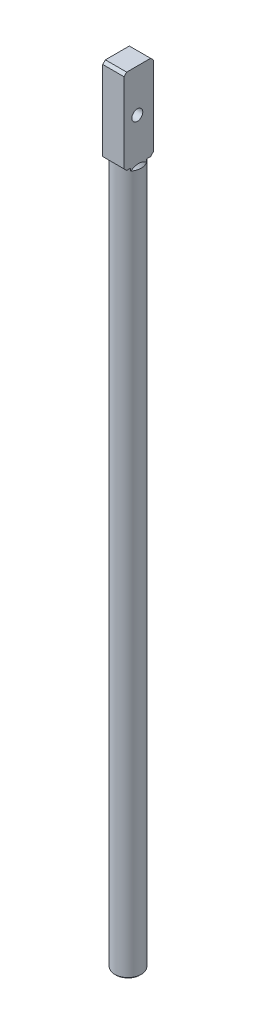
ISO-10303-21;
HEADER;
FILE_DESCRIPTION(('STEP AP214'),'2;1');
FILE_NAME('part.step','',(''),(''),'','','');
FILE_SCHEMA(('AUTOMOTIVE_DESIGN { 1 0 10303 214 1 1 1 1 }'));
ENDSEC;
DATA;
#1=APPLICATION_CONTEXT('core data for automotive mechanical design processes');
#2=APPLICATION_PROTOCOL_DEFINITION('international standard','automotive_design',2000,#1);
#3=PRODUCT_CONTEXT('',#1,'mechanical');
#4=PRODUCT('Part','Part','',(#3));
#5=PRODUCT_RELATED_PRODUCT_CATEGORY('part','',(#4));
#6=PRODUCT_DEFINITION_FORMATION('','',#4);
#7=PRODUCT_DEFINITION_CONTEXT('part definition',#1,'design');
#8=PRODUCT_DEFINITION('design','',#6,#7);
#9=PRODUCT_DEFINITION_SHAPE('','',#8);
#10=(LENGTH_UNIT() NAMED_UNIT(*) SI_UNIT(.MILLI.,.METRE.));
#11=(NAMED_UNIT(*) PLANE_ANGLE_UNIT() SI_UNIT($,.RADIAN.));
#12=(NAMED_UNIT(*) SI_UNIT($,.STERADIAN.) SOLID_ANGLE_UNIT());
#13=UNCERTAINTY_MEASURE_WITH_UNIT(LENGTH_MEASURE(1.E-05),#10,'distance_accuracy_value','');
#14=(GEOMETRIC_REPRESENTATION_CONTEXT(3) GLOBAL_UNCERTAINTY_ASSIGNED_CONTEXT((#13)) GLOBAL_UNIT_ASSIGNED_CONTEXT((#10,
#11,#12)) REPRESENTATION_CONTEXT('',''));
#15=CARTESIAN_POINT('',(0.,0.,0.));
#16=DIRECTION('',(0.,0.,1.));
#17=DIRECTION('',(1.,0.,0.));
#18=AXIS2_PLACEMENT_3D('',#15,#16,#17);
#19=CARTESIAN_POINT('',(4.,264.,-5.5));
#20=DIRECTION('',(0.,-1.,0.));
#21=DIRECTION('',(0.,0.,-1.));
#22=AXIS2_PLACEMENT_3D('',#19,#20,#21);
#23=PLANE('',#22);
#24=DIRECTION('',(0.,0.,1.));
#25=VECTOR('',#24,1.);
#26=CARTESIAN_POINT('',(-4.,264.,5.5));
#27=LINE('',#26,#25);
#28=CARTESIAN_POINT('',(-4.,264.,-4.49999999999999));
#29=VERTEX_POINT('',#28);
#30=CARTESIAN_POINT('',(-4.,264.,-3.));
#31=VERTEX_POINT('',#30);
#32=EDGE_CURVE('E344',#29,#31,#27,.T.);
#33=ORIENTED_EDGE('',*,*,#32,.F.);
#34=DIRECTION('',(1.,0.,0.));
#35=VECTOR('',#34,1.);
#36=CARTESIAN_POINT('',(4.,264.,-4.49999999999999));
#37=LINE('',#36,#35);
#38=CARTESIAN_POINT('',(-2.17944947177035,264.,-4.49999999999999));
#39=VERTEX_POINT('',#38);
#40=EDGE_CURVE('E225',#29,#39,#37,.T.);
#41=ORIENTED_EDGE('',*,*,#40,.T.);
#42=CARTESIAN_POINT('',(0.,264.,0.));
#43=DIRECTION('',(0.,1.,0.));
#44=DIRECTION('',(0.,0.,1.));
#45=AXIS2_PLACEMENT_3D('',#42,#43,#44);
#46=CIRCLE('',#45,5.);
#47=EDGE_CURVE('E170',#39,#31,#46,.T.);
#48=ORIENTED_EDGE('',*,*,#47,.T.);
#49=EDGE_LOOP('',(#33,#41,#48));
#50=FACE_BOUND('',#49,.T.);
#51=ADVANCED_FACE('F36',(#50),#23,.T.);
#52=DIRECTION('',(0.,0.,-1.));
#53=VECTOR('',#52,1.);
#54=CARTESIAN_POINT('',(4.,264.,5.5));
#55=LINE('',#54,#53);
#56=CARTESIAN_POINT('',(4.,264.,4.49999999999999));
#57=VERTEX_POINT('',#56);
#58=CARTESIAN_POINT('',(4.,264.,3.));
#59=VERTEX_POINT('',#58);
#60=EDGE_CURVE('E144',#57,#59,#55,.T.);
#61=ORIENTED_EDGE('',*,*,#60,.F.);
#62=DIRECTION('',(-1.,0.,0.));
#63=VECTOR('',#62,1.);
#64=CARTESIAN_POINT('',(-4.,264.,4.49999999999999));
#65=LINE('',#64,#63);
#66=CARTESIAN_POINT('',(2.17944947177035,264.,4.49999999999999));
#67=VERTEX_POINT('',#66);
#68=EDGE_CURVE('E166',#57,#67,#65,.T.);
#69=ORIENTED_EDGE('',*,*,#68,.T.);
#70=EDGE_CURVE('E160',#67,#59,#46,.T.);
#71=ORIENTED_EDGE('',*,*,#70,.T.);
#72=EDGE_LOOP('',(#61,#69,#71));
#73=FACE_BOUND('',#72,.T.);
#74=ADVANCED_FACE('F165',(#73),#23,.T.);
#75=CARTESIAN_POINT('',(0.,264.,0.));
#76=DIRECTION('',(0.,-1.,0.));
#77=DIRECTION('',(0.,0.,-1.));
#78=AXIS2_PLACEMENT_3D('',#75,#76,#77);
#79=CYLINDRICAL_SURFACE('',#78,5.);
#80=CARTESIAN_POINT('',(0.,0.500000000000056,0.));
#81=DIRECTION('',(0.,1.,0.));
#82=DIRECTION('',(0.,0.,1.));
#83=AXIS2_PLACEMENT_3D('',#80,#81,#82);
#84=CIRCLE('',#83,5.);
#85=CARTESIAN_POINT('',(0.,0.500000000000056,5.));
#86=VERTEX_POINT('',#85);
#87=EDGE_CURVE('E44',#86,#86,#84,.T.);
#88=ORIENTED_EDGE('',*,*,#87,.T.);
#89=EDGE_LOOP('',(#88));
#90=FACE_BOUND('',#89,.T.);
#91=CARTESIAN_POINT('',(4.,264.,-3.));
#92=VERTEX_POINT('',#91);
#93=CARTESIAN_POINT('',(2.17944947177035,264.,-4.49999999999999));
#94=VERTEX_POINT('',#93);
#95=EDGE_CURVE('E172',#92,#94,#46,.T.);
#96=ORIENTED_EDGE('',*,*,#95,.F.);
#97=DIRECTION('',(0.,-1.,0.));
#98=VECTOR('',#97,1.);
#99=CARTESIAN_POINT('',(4.,264.,-3.));
#100=LINE('',#99,#98);
#101=CARTESIAN_POINT('',(4.,263.,-3.));
#102=VERTEX_POINT('',#101);
#103=EDGE_CURVE('E59',#92,#102,#100,.T.);
#104=ORIENTED_EDGE('',*,*,#103,.T.);
#105=CARTESIAN_POINT('',(0.,263.,0.));
#106=DIRECTION('',(0.,1.,0.));
#107=DIRECTION('',(0.,0.,1.));
#108=AXIS2_PLACEMENT_3D('',#105,#106,#107);
#109=CIRCLE('',#108,5.);
#110=CARTESIAN_POINT('',(4.,263.,3.));
#111=VERTEX_POINT('',#110);
#112=EDGE_CURVE('E163',#102,#111,#109,.F.);
#113=ORIENTED_EDGE('',*,*,#112,.T.);
#114=DIRECTION('',(0.,-1.,0.));
#115=VECTOR('',#114,1.);
#116=CARTESIAN_POINT('',(4.,263.,3.));
#117=LINE('',#116,#115);
#118=EDGE_CURVE('E148',#111,#59,#117,.F.);
#119=ORIENTED_EDGE('',*,*,#118,.T.);
#120=ORIENTED_EDGE('',*,*,#70,.F.);
#121=CARTESIAN_POINT('',(0.,259.5,0.));
#122=DIRECTION('',(0.,-0.70710678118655,0.707106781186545));
#123=DIRECTION('',(0.,-0.707106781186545,-0.70710678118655));
#124=AXIS2_PLACEMENT_3D('',#121,#122,#123);
#125=ELLIPSE('',#124,7.07106781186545,5.);
#126=CARTESIAN_POINT('',(-2.17944947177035,264.,4.49999999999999));
#127=VERTEX_POINT('',#126);
#128=EDGE_CURVE('E275',#67,#127,#125,.T.);
#129=ORIENTED_EDGE('',*,*,#128,.T.);
#130=CARTESIAN_POINT('',(-4.,264.,3.));
#131=VERTEX_POINT('',#130);
#132=EDGE_CURVE('E167',#131,#127,#46,.T.);
#133=ORIENTED_EDGE('',*,*,#132,.F.);
#134=DIRECTION('',(0.,-1.,0.));
#135=VECTOR('',#134,1.);
#136=CARTESIAN_POINT('',(-4.,264.,3.));
#137=LINE('',#136,#135);
#138=CARTESIAN_POINT('',(-4.,263.,3.));
#139=VERTEX_POINT('',#138);
#140=EDGE_CURVE('E51',#131,#139,#137,.T.);
#141=ORIENTED_EDGE('',*,*,#140,.T.);
#142=CARTESIAN_POINT('',(0.,263.,0.));
#143=DIRECTION('',(0.,1.,0.));
#144=DIRECTION('',(0.,0.,1.));
#145=AXIS2_PLACEMENT_3D('',#142,#143,#144);
#146=CIRCLE('',#145,5.);
#147=CARTESIAN_POINT('',(-4.,263.,-3.));
#148=VERTEX_POINT('',#147);
#149=EDGE_CURVE('E187',#139,#148,#146,.F.);
#150=ORIENTED_EDGE('',*,*,#149,.T.);
#151=DIRECTION('',(0.,-1.,0.));
#152=VECTOR('',#151,1.);
#153=CARTESIAN_POINT('',(-4.,263.,-3.));
#154=LINE('',#153,#152);
#155=EDGE_CURVE('E182',#148,#31,#154,.F.);
#156=ORIENTED_EDGE('',*,*,#155,.T.);
#157=ORIENTED_EDGE('',*,*,#47,.F.);
#158=CARTESIAN_POINT('',(0.,259.5,0.));
#159=DIRECTION('',(0.,-0.70710678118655,-0.707106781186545));
#160=DIRECTION('',(0.,-0.707106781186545,0.70710678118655));
#161=AXIS2_PLACEMENT_3D('',#158,#159,#160);
#162=ELLIPSE('',#161,7.07106781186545,5.);
#163=EDGE_CURVE('E323',#39,#94,#162,.T.);
#164=ORIENTED_EDGE('',*,*,#163,.T.);
#165=EDGE_LOOP('',(#96,#104,#113,#119,#120,#129,#133,#141,#150,#156,#157,#164));
#166=FACE_BOUND('',#165,.T.);
#167=ADVANCED_FACE('F159',(#90,#166),#79,.T.);
#168=CARTESIAN_POINT('',(0.,0.,0.));
#169=DIRECTION('',(0.,1.,0.));
#170=DIRECTION('',(0.,0.,1.));
#171=AXIS2_PLACEMENT_3D('',#168,#169,#170);
#172=PLANE('',#171);
#173=CARTESIAN_POINT('',(0.,0.,0.));
#174=DIRECTION('',(0.,1.,0.));
#175=DIRECTION('',(0.,0.,1.));
#176=AXIS2_PLACEMENT_3D('',#173,#174,#175);
#177=CIRCLE('',#176,4.49999999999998);
#178=CARTESIAN_POINT('',(0.,0.,4.49999999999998));
#179=VERTEX_POINT('',#178);
#180=EDGE_CURVE('E11',#179,#179,#177,.F.);
#181=ORIENTED_EDGE('',*,*,#180,.T.);
#182=EDGE_LOOP('',(#181));
#183=FACE_BOUND('',#182,.T.);
#184=ADVANCED_FACE('F306',(#183),#172,.F.);
#185=ORIENTED_EDGE('',*,*,#95,.T.);
#186=DIRECTION('',(1.,0.,0.));
#187=VECTOR('',#186,1.);
#188=CARTESIAN_POINT('',(4.,264.,-4.49999999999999));
#189=LINE('',#188,#187);
#190=CARTESIAN_POINT('',(4.,264.,-4.49999999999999));
#191=VERTEX_POINT('',#190);
#192=EDGE_CURVE('E223',#94,#191,#189,.T.);
#193=ORIENTED_EDGE('',*,*,#192,.T.);
#194=EDGE_CURVE('E155',#92,#191,#55,.T.);
#195=ORIENTED_EDGE('',*,*,#194,.F.);
#196=EDGE_LOOP('',(#185,#193,#195));
#197=FACE_BOUND('',#196,.T.);
#198=ADVANCED_FACE('F291',(#197),#23,.T.);
#199=CARTESIAN_POINT('',(4.,296.,5.5));
#200=DIRECTION('',(-1.,0.,0.));
#201=DIRECTION('',(0.,0.,1.));
#202=AXIS2_PLACEMENT_3D('',#199,#200,#201);
#203=PLANE('',#202);
#204=CARTESIAN_POINT('',(4.,280.,0.5));
#205=DIRECTION('',(-1.,0.,0.));
#206=DIRECTION('',(0.,0.,1.));
#207=AXIS2_PLACEMENT_3D('',#204,#205,#206);
#208=CIRCLE('',#207,2.05000000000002);
#209=CARTESIAN_POINT('',(4.,280.,2.55000000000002));
#210=VERTEX_POINT('',#209);
#211=EDGE_CURVE('E351',#210,#210,#208,.T.);
#212=ORIENTED_EDGE('',*,*,#211,.T.);
#213=EDGE_LOOP('',(#212));
#214=FACE_BOUND('',#213,.T.);
#215=DIRECTION('',(0.,-1.,0.));
#216=VECTOR('',#215,1.);
#217=CARTESIAN_POINT('',(4.,296.,5.5));
#218=LINE('',#217,#216);
#219=CARTESIAN_POINT('',(4.,295.,5.5));
#220=VERTEX_POINT('',#219);
#221=CARTESIAN_POINT('',(4.,265.,5.5));
#222=VERTEX_POINT('',#221);
#223=EDGE_CURVE('E337',#220,#222,#218,.T.);
#224=ORIENTED_EDGE('',*,*,#223,.T.);
#225=DIRECTION('',(0.,-0.707106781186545,-0.70710678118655));
#226=VECTOR('',#225,1.);
#227=CARTESIAN_POINT('',(4.,265.,5.5));
#228=LINE('',#227,#226);
#229=EDGE_CURVE('E150',#222,#57,#228,.T.);
#230=ORIENTED_EDGE('',*,*,#229,.T.);
#231=ORIENTED_EDGE('',*,*,#60,.T.);
#232=ORIENTED_EDGE('',*,*,#118,.F.);
#233=CARTESIAN_POINT('',(4.,263.,3.));
#234=CARTESIAN_POINT('',(4.,263.043418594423,2.92762836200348));
#235=CARTESIAN_POINT('',(4.,263.086104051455,2.85481802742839));
#236=CARTESIAN_POINT('',(4.,263.16980105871,2.70821938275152));
#237=CARTESIAN_POINT('',(4.,263.210812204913,2.63443084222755));
#238=CARTESIAN_POINT('',(4.,263.331258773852,2.41100406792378));
#239=CARTESIAN_POINT('',(4.,263.407814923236,2.25978602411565));
#240=CARTESIAN_POINT('',(4.,263.549076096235,1.95659067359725));
#241=CARTESIAN_POINT('',(4.,263.614035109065,1.80473273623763));
#242=CARTESIAN_POINT('',(4.,263.731616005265,1.49644202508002));
#243=CARTESIAN_POINT('',(4.,263.784254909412,1.34001590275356));
#244=CARTESIAN_POINT('',(4.,263.856172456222,1.08612110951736));
#245=CARTESIAN_POINT('',(4.,263.880380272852,0.990042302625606));
#246=CARTESIAN_POINT('',(4.,263.922558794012,0.796520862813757));
#247=CARTESIAN_POINT('',(4.,263.940530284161,0.699078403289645));
#248=CARTESIAN_POINT('',(4.,263.969854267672,0.501704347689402));
#249=CARTESIAN_POINT('',(4.,263.981104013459,0.401757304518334));
#250=CARTESIAN_POINT('',(4.,263.99620468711,0.201215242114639));
#251=CARTESIAN_POINT('',(4.,264.000048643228,0.100619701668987));
#252=CARTESIAN_POINT('',(4.,264.,0.));
#253=B_SPLINE_CURVE_WITH_KNOTS('',3,(#233,#234,#235,#236,#237,#238,#239,#240,#241,#242,#243,
#244,#245,#246,#247,#248,#249,#250,#251,#252),.UNSPECIFIED.,.F.,.F.,(4,2,2,2,2,2,2,2,2,4),(0.,
0.253181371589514,0.506423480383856,1.01459556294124,1.50970891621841,2.00413415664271,
2.30120350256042,2.59823541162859,2.89969868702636,3.20144561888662),.UNSPECIFIED.);
#254=CARTESIAN_POINT('',(4.00000000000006,264.,0.));
#255=VERTEX_POINT('',#254);
#256=EDGE_CURVE('E240',#111,#255,#253,.T.);
#257=ORIENTED_EDGE('',*,*,#256,.T.);
#258=CARTESIAN_POINT('',(4.00000000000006,264.,0.));
#259=CARTESIAN_POINT('',(4.00000000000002,264.000004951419,-0.0614896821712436));
#260=CARTESIAN_POINT('',(4.00000000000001,263.99858142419,-0.122970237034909));
#261=CARTESIAN_POINT('',(3.99999999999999,263.992923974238,-0.245792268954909));
#262=CARTESIAN_POINT('',(4.,263.988690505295,-0.307133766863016));
#263=CARTESIAN_POINT('',(4.,263.971868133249,-0.490538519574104));
#264=CARTESIAN_POINT('',(4.,263.955156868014,-0.612243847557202));
#265=CARTESIAN_POINT('',(4.,263.911987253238,-0.851773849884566));
#266=CARTESIAN_POINT('',(4.,263.885695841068,-0.969629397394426));
#267=CARTESIAN_POINT('',(4.,263.824503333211,-1.20311028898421));
#268=CARTESIAN_POINT('',(4.,263.789598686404,-1.31873469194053));
#269=CARTESIAN_POINT('',(4.,263.705139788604,-1.56915278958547));
#270=CARTESIAN_POINT('',(4.,263.654062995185,-1.70342909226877));
#271=CARTESIAN_POINT('',(4.,263.543490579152,-1.96849997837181));
#272=CARTESIAN_POINT('',(4.,263.483990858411,-2.09929282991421));
#273=CARTESIAN_POINT('',(4.,263.356956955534,-2.36033095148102));
#274=CARTESIAN_POINT('',(4.,263.289278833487,-2.49050544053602));
#275=CARTESIAN_POINT('',(4.,263.148432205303,-2.74756392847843));
#276=CARTESIAN_POINT('',(4.,263.075273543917,-2.87445330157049));
#277=CARTESIAN_POINT('',(4.,263.,-2.99999999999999));
#278=B_SPLINE_CURVE_WITH_KNOTS('',3,(#258,#259,#260,#261,#262,#263,#264,#265,#266,#267,#268,
#269,#270,#271,#272,#273,#274,#275,#276,#277),.UNSPECIFIED.,.F.,.F.,(4,2,2,2,2,2,2,2,2,4),(0.,
0.184435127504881,0.36884047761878,0.736868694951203,1.09876868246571,1.4608181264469,
1.8914446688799,2.32228145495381,2.76227942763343,3.20150515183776),.UNSPECIFIED.);
#279=EDGE_CURVE('E233',#255,#102,#278,.T.);
#280=ORIENTED_EDGE('',*,*,#279,.T.);
#281=ORIENTED_EDGE('',*,*,#103,.F.);
#282=ORIENTED_EDGE('',*,*,#194,.T.);
#283=DIRECTION('',(0.,0.707106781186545,-0.70710678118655));
#284=VECTOR('',#283,1.);
#285=CARTESIAN_POINT('',(4.,265.,-5.5));
#286=LINE('',#285,#284);
#287=CARTESIAN_POINT('',(4.,265.,-5.5));
#288=VERTEX_POINT('',#287);
#289=EDGE_CURVE('E204',#191,#288,#286,.T.);
#290=ORIENTED_EDGE('',*,*,#289,.T.);
#291=DIRECTION('',(0.,-1.,0.));
#292=VECTOR('',#291,1.);
#293=CARTESIAN_POINT('',(4.,296.,-5.5));
#294=LINE('',#293,#292);
#295=CARTESIAN_POINT('',(4.,295.,-5.5));
#296=VERTEX_POINT('',#295);
#297=EDGE_CURVE('E168',#296,#288,#294,.T.);
#298=ORIENTED_EDGE('',*,*,#297,.F.);
#299=DIRECTION('',(0.,-0.707106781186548,-0.707106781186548));
#300=VECTOR('',#299,1.);
#301=CARTESIAN_POINT('',(4.,296.,-4.5));
#302=LINE('',#301,#300);
#303=CARTESIAN_POINT('',(4.,296.,-4.5));
#304=VERTEX_POINT('',#303);
#305=EDGE_CURVE('E200',#296,#304,#302,.F.);
#306=ORIENTED_EDGE('',*,*,#305,.T.);
#307=DIRECTION('',(0.,0.,-1.));
#308=VECTOR('',#307,1.);
#309=CARTESIAN_POINT('',(4.,296.,5.5));
#310=LINE('',#309,#308);
#311=CARTESIAN_POINT('',(4.,296.,4.5));
#312=VERTEX_POINT('',#311);
#313=EDGE_CURVE('E345',#312,#304,#310,.T.);
#314=ORIENTED_EDGE('',*,*,#313,.F.);
#315=DIRECTION('',(0.,0.707106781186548,-0.707106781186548));
#316=VECTOR('',#315,1.);
#317=CARTESIAN_POINT('',(4.,296.,4.5));
#318=LINE('',#317,#316);
#319=EDGE_CURVE('E202',#312,#220,#318,.F.);
#320=ORIENTED_EDGE('',*,*,#319,.T.);
#321=EDGE_LOOP('',(#224,#230,#231,#232,#257,#280,#281,#282,#290,#298,#306,#314,#320));
#322=FACE_BOUND('',#321,.T.);
#323=ADVANCED_FACE('F147',(#214,#322),#203,.F.);
#324=CARTESIAN_POINT('',(-4.,296.,-5.5));
#325=DIRECTION('',(0.,0.,1.));
#326=DIRECTION('',(1.,0.,0.));
#327=AXIS2_PLACEMENT_3D('',#324,#325,#326);
#328=PLANE('',#327);
#329=ORIENTED_EDGE('',*,*,#297,.T.);
#330=DIRECTION('',(-1.,0.,0.));
#331=VECTOR('',#330,1.);
#332=CARTESIAN_POINT('',(-4.,265.,-5.5));
#333=LINE('',#332,#331);
#334=CARTESIAN_POINT('',(-4.,265.,-5.5));
#335=VERTEX_POINT('',#334);
#336=EDGE_CURVE('E220',#288,#335,#333,.T.);
#337=ORIENTED_EDGE('',*,*,#336,.T.);
#338=DIRECTION('',(0.,-1.,0.));
#339=VECTOR('',#338,1.);
#340=CARTESIAN_POINT('',(-4.,296.,-5.5));
#341=LINE('',#340,#339);
#342=CARTESIAN_POINT('',(-4.,295.,-5.5));
#343=VERTEX_POINT('',#342);
#344=EDGE_CURVE('E174',#343,#335,#341,.T.);
#345=ORIENTED_EDGE('',*,*,#344,.F.);
#346=DIRECTION('',(1.,0.,0.));
#347=VECTOR('',#346,1.);
#348=CARTESIAN_POINT('',(-4.,295.,-5.5));
#349=LINE('',#348,#347);
#350=EDGE_CURVE('E218',#343,#296,#349,.T.);
#351=ORIENTED_EDGE('',*,*,#350,.T.);
#352=EDGE_LOOP('',(#329,#337,#345,#351));
#353=FACE_BOUND('',#352,.T.);
#354=ADVANCED_FACE('F282',(#353),#328,.F.);
#355=CARTESIAN_POINT('',(-4.,296.,5.5));
#356=DIRECTION('',(1.,0.,0.));
#357=DIRECTION('',(0.,0.,-1.));
#358=AXIS2_PLACEMENT_3D('',#355,#356,#357);
#359=PLANE('',#358);
#360=CARTESIAN_POINT('',(-4.,280.,0.5));
#361=DIRECTION('',(-1.,0.,0.));
#362=DIRECTION('',(0.,0.,1.));
#363=AXIS2_PLACEMENT_3D('',#360,#361,#362);
#364=CIRCLE('',#363,2.05000000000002);
#365=CARTESIAN_POINT('',(-4.,280.,2.55000000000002));
#366=VERTEX_POINT('',#365);
#367=EDGE_CURVE('E354',#366,#366,#364,.T.);
#368=ORIENTED_EDGE('',*,*,#367,.F.);
#369=EDGE_LOOP('',(#368));
#370=FACE_BOUND('',#369,.T.);
#371=CARTESIAN_POINT('',(-4.,264.,4.49999999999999));
#372=VERTEX_POINT('',#371);
#373=EDGE_CURVE('E154',#131,#372,#27,.T.);
#374=ORIENTED_EDGE('',*,*,#373,.T.);
#375=DIRECTION('',(0.,0.707106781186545,0.70710678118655));
#376=VECTOR('',#375,1.);
#377=CARTESIAN_POINT('',(-4.,265.,5.5));
#378=LINE('',#377,#376);
#379=CARTESIAN_POINT('',(-4.,265.,5.5));
#380=VERTEX_POINT('',#379);
#381=EDGE_CURVE('E216',#372,#380,#378,.T.);
#382=ORIENTED_EDGE('',*,*,#381,.T.);
#383=DIRECTION('',(0.,-1.,0.));
#384=VECTOR('',#383,1.);
#385=CARTESIAN_POINT('',(-4.,296.,5.5));
#386=LINE('',#385,#384);
#387=CARTESIAN_POINT('',(-4.,295.,5.5));
#388=VERTEX_POINT('',#387);
#389=EDGE_CURVE('E332',#388,#380,#386,.T.);
#390=ORIENTED_EDGE('',*,*,#389,.F.);
#391=DIRECTION('',(0.,-0.707106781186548,0.707106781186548));
#392=VECTOR('',#391,1.);
#393=CARTESIAN_POINT('',(-4.,296.,4.5));
#394=LINE('',#393,#392);
#395=CARTESIAN_POINT('',(-4.,296.,4.5));
#396=VERTEX_POINT('',#395);
#397=EDGE_CURVE('E212',#388,#396,#394,.F.);
#398=ORIENTED_EDGE('',*,*,#397,.T.);
#399=DIRECTION('',(0.,0.,1.));
#400=VECTOR('',#399,1.);
#401=CARTESIAN_POINT('',(-4.,296.,5.5));
#402=LINE('',#401,#400);
#403=CARTESIAN_POINT('',(-4.,296.,-4.5));
#404=VERTEX_POINT('',#403);
#405=EDGE_CURVE('E341',#404,#396,#402,.T.);
#406=ORIENTED_EDGE('',*,*,#405,.F.);
#407=DIRECTION('',(0.,0.707106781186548,0.707106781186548));
#408=VECTOR('',#407,1.);
#409=CARTESIAN_POINT('',(-4.,296.,-4.5));
#410=LINE('',#409,#408);
#411=EDGE_CURVE('E210',#404,#343,#410,.F.);
#412=ORIENTED_EDGE('',*,*,#411,.T.);
#413=ORIENTED_EDGE('',*,*,#344,.T.);
#414=DIRECTION('',(0.,-0.707106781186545,0.70710678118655));
#415=VECTOR('',#414,1.);
#416=CARTESIAN_POINT('',(-4.,265.,-5.5));
#417=LINE('',#416,#415);
#418=EDGE_CURVE('E214',#335,#29,#417,.T.);
#419=ORIENTED_EDGE('',*,*,#418,.T.);
#420=ORIENTED_EDGE('',*,*,#32,.T.);
#421=ORIENTED_EDGE('',*,*,#155,.F.);
#422=CARTESIAN_POINT('',(-4.,263.,-3.));
#423=CARTESIAN_POINT('',(-4.,263.043418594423,-2.92762836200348));
#424=CARTESIAN_POINT('',(-4.,263.086104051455,-2.85481802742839));
#425=CARTESIAN_POINT('',(-4.,263.16980105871,-2.70821938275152));
#426=CARTESIAN_POINT('',(-4.,263.210812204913,-2.63443084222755));
#427=CARTESIAN_POINT('',(-4.,263.331258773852,-2.41100406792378));
#428=CARTESIAN_POINT('',(-4.,263.407814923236,-2.25978602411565));
#429=CARTESIAN_POINT('',(-4.,263.549076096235,-1.95659067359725));
#430=CARTESIAN_POINT('',(-4.,263.614035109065,-1.80473273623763));
#431=CARTESIAN_POINT('',(-4.,263.731616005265,-1.49644202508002));
#432=CARTESIAN_POINT('',(-4.,263.784254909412,-1.34001590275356));
#433=CARTESIAN_POINT('',(-4.,263.856172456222,-1.08612110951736));
#434=CARTESIAN_POINT('',(-4.,263.880380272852,-0.990042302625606));
#435=CARTESIAN_POINT('',(-4.,263.922558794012,-0.796520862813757));
#436=CARTESIAN_POINT('',(-4.,263.940530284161,-0.699078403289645));
#437=CARTESIAN_POINT('',(-4.,263.969854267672,-0.501704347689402));
#438=CARTESIAN_POINT('',(-4.,263.981104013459,-0.401757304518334));
#439=CARTESIAN_POINT('',(-4.,263.99620468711,-0.201215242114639));
#440=CARTESIAN_POINT('',(-4.,264.000048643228,-0.100619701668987));
#441=CARTESIAN_POINT('',(-4.,264.,0.));
#442=B_SPLINE_CURVE_WITH_KNOTS('',3,(#422,#423,#424,#425,#426,#427,#428,#429,#430,#431,#432,
#433,#434,#435,#436,#437,#438,#439,#440,#441),.UNSPECIFIED.,.F.,.F.,(4,2,2,2,2,2,2,2,2,4),(0.,
0.253181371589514,0.506423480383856,1.01459556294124,1.50970891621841,2.00413415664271,
2.30120350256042,2.59823541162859,2.89969868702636,3.20144561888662),.UNSPECIFIED.);
#443=CARTESIAN_POINT('',(-4.00000000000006,264.,0.));
#444=VERTEX_POINT('',#443);
#445=EDGE_CURVE('E270',#148,#444,#442,.T.);
#446=ORIENTED_EDGE('',*,*,#445,.T.);
#447=CARTESIAN_POINT('',(-4.00000000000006,264.,0.));
#448=CARTESIAN_POINT('',(-4.00000000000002,264.000004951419,0.0614896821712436));
#449=CARTESIAN_POINT('',(-4.00000000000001,263.99858142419,0.122970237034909));
#450=CARTESIAN_POINT('',(-3.99999999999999,263.992923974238,0.245792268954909));
#451=CARTESIAN_POINT('',(-4.,263.988690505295,0.307133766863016));
#452=CARTESIAN_POINT('',(-4.,263.971868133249,0.490538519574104));
#453=CARTESIAN_POINT('',(-4.,263.955156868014,0.612243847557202));
#454=CARTESIAN_POINT('',(-4.,263.911987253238,0.851773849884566));
#455=CARTESIAN_POINT('',(-4.,263.885695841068,0.969629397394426));
#456=CARTESIAN_POINT('',(-4.,263.824503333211,1.20311028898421));
#457=CARTESIAN_POINT('',(-4.,263.789598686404,1.31873469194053));
#458=CARTESIAN_POINT('',(-4.,263.705139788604,1.56915278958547));
#459=CARTESIAN_POINT('',(-4.,263.654062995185,1.70342909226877));
#460=CARTESIAN_POINT('',(-4.,263.543490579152,1.96849997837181));
#461=CARTESIAN_POINT('',(-4.,263.483990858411,2.09929282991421));
#462=CARTESIAN_POINT('',(-4.,263.356956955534,2.36033095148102));
#463=CARTESIAN_POINT('',(-4.,263.289278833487,2.49050544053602));
#464=CARTESIAN_POINT('',(-4.,263.148432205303,2.74756392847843));
#465=CARTESIAN_POINT('',(-4.,263.075273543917,2.87445330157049));
#466=CARTESIAN_POINT('',(-4.,263.,2.99999999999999));
#467=B_SPLINE_CURVE_WITH_KNOTS('',3,(#447,#448,#449,#450,#451,#452,#453,#454,#455,#456,#457,
#458,#459,#460,#461,#462,#463,#464,#465,#466),.UNSPECIFIED.,.F.,.F.,(4,2,2,2,2,2,2,2,2,4),(0.,
0.184435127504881,0.36884047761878,0.736868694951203,1.09876868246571,1.4608181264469,
1.8914446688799,2.32228145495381,2.76227942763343,3.20150515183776),.UNSPECIFIED.);
#468=EDGE_CURVE('E264',#444,#139,#467,.T.);
#469=ORIENTED_EDGE('',*,*,#468,.T.);
#470=ORIENTED_EDGE('',*,*,#140,.F.);
#471=EDGE_LOOP('',(#374,#382,#390,#398,#406,#412,#413,#419,#420,#421,#446,#469,#470));
#472=FACE_BOUND('',#471,.T.);
#473=ADVANCED_FACE('F277',(#370,#472),#359,.F.);
#474=CARTESIAN_POINT('',(-4.,296.,5.5));
#475=DIRECTION('',(0.,0.,-1.));
#476=DIRECTION('',(-1.,0.,0.));
#477=AXIS2_PLACEMENT_3D('',#474,#475,#476);
#478=PLANE('',#477);
#479=ORIENTED_EDGE('',*,*,#389,.T.);
#480=DIRECTION('',(1.,0.,0.));
#481=VECTOR('',#480,1.);
#482=CARTESIAN_POINT('',(4.,265.,5.5));
#483=LINE('',#482,#481);
#484=EDGE_CURVE('E197',#380,#222,#483,.T.);
#485=ORIENTED_EDGE('',*,*,#484,.T.);
#486=ORIENTED_EDGE('',*,*,#223,.F.);
#487=DIRECTION('',(-1.,0.,0.));
#488=VECTOR('',#487,1.);
#489=CARTESIAN_POINT('',(-4.,295.,5.5));
#490=LINE('',#489,#488);
#491=EDGE_CURVE('E195',#220,#388,#490,.T.);
#492=ORIENTED_EDGE('',*,*,#491,.T.);
#493=EDGE_LOOP('',(#479,#485,#486,#492));
#494=FACE_BOUND('',#493,.T.);
#495=ADVANCED_FACE('F281',(#494),#478,.F.);
#496=CARTESIAN_POINT('',(4.,296.,-5.5));
#497=DIRECTION('',(0.,-1.,0.));
#498=DIRECTION('',(0.,0.,-1.));
#499=AXIS2_PLACEMENT_3D('',#496,#497,#498);
#500=PLANE('',#499);
#501=ORIENTED_EDGE('',*,*,#405,.T.);
#502=DIRECTION('',(1.,0.,0.));
#503=VECTOR('',#502,1.);
#504=CARTESIAN_POINT('',(4.,296.,4.5));
#505=LINE('',#504,#503);
#506=EDGE_CURVE('E230',#396,#312,#505,.T.);
#507=ORIENTED_EDGE('',*,*,#506,.T.);
#508=ORIENTED_EDGE('',*,*,#313,.T.);
#509=DIRECTION('',(-1.,0.,0.));
#510=VECTOR('',#509,1.);
#511=CARTESIAN_POINT('',(4.,296.,-4.5));
#512=LINE('',#511,#510);
#513=EDGE_CURVE('E227',#304,#404,#512,.T.);
#514=ORIENTED_EDGE('',*,*,#513,.T.);
#515=EDGE_LOOP('',(#501,#507,#508,#514));
#516=FACE_BOUND('',#515,.T.);
#517=ADVANCED_FACE('F299',(#516),#500,.F.);
#518=ORIENTED_EDGE('',*,*,#132,.T.);
#519=DIRECTION('',(-1.,0.,0.));
#520=VECTOR('',#519,1.);
#521=CARTESIAN_POINT('',(-4.,264.,4.49999999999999));
#522=LINE('',#521,#520);
#523=EDGE_CURVE('E207',#127,#372,#522,.T.);
#524=ORIENTED_EDGE('',*,*,#523,.T.);
#525=ORIENTED_EDGE('',*,*,#373,.F.);
#526=EDGE_LOOP('',(#518,#524,#525));
#527=FACE_BOUND('',#526,.T.);
#528=ADVANCED_FACE('F254',(#527),#23,.T.);
#529=CARTESIAN_POINT('',(0.,264.,0.));
#530=DIRECTION('',(0.,-1.,0.));
#531=DIRECTION('',(0.,0.,-1.));
#532=AXIS2_PLACEMENT_3D('',#529,#530,#531);
#533=CONICAL_SURFACE('',#532,4.00000000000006,0.785398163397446);
#534=ORIENTED_EDGE('',*,*,#256,.F.);
#535=ORIENTED_EDGE('',*,*,#112,.F.);
#536=ORIENTED_EDGE('',*,*,#279,.F.);
#537=EDGE_LOOP('',(#534,#535,#536));
#538=FACE_BOUND('',#537,.T.);
#539=ADVANCED_FACE('F248',(#538),#533,.T.);
#540=CARTESIAN_POINT('',(0.,264.,0.));
#541=DIRECTION('',(0.,-1.,0.));
#542=DIRECTION('',(0.,0.,-1.));
#543=AXIS2_PLACEMENT_3D('',#540,#541,#542);
#544=CONICAL_SURFACE('',#543,4.00000000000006,0.785398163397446);
#545=ORIENTED_EDGE('',*,*,#445,.F.);
#546=ORIENTED_EDGE('',*,*,#149,.F.);
#547=ORIENTED_EDGE('',*,*,#468,.F.);
#548=EDGE_LOOP('',(#545,#546,#547));
#549=FACE_BOUND('',#548,.T.);
#550=ADVANCED_FACE('F253',(#549),#544,.T.);
#551=CARTESIAN_POINT('',(-4.,265.,5.5));
#552=DIRECTION('',(0.,-0.70710678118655,0.707106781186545));
#553=DIRECTION('',(0.,-0.707106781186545,-0.70710678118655));
#554=AXIS2_PLACEMENT_3D('',#551,#552,#553);
#555=PLANE('',#554);
#556=ORIENTED_EDGE('',*,*,#128,.F.);
#557=ORIENTED_EDGE('',*,*,#68,.F.);
#558=ORIENTED_EDGE('',*,*,#229,.F.);
#559=ORIENTED_EDGE('',*,*,#484,.F.);
#560=ORIENTED_EDGE('',*,*,#381,.F.);
#561=ORIENTED_EDGE('',*,*,#523,.F.);
#562=EDGE_LOOP('',(#556,#557,#558,#559,#560,#561));
#563=FACE_BOUND('',#562,.T.);
#564=ADVANCED_FACE('F260',(#563),#555,.T.);
#565=CARTESIAN_POINT('',(-4.,265.,-5.5));
#566=DIRECTION('',(0.,-0.70710678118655,-0.707106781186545));
#567=DIRECTION('',(0.,0.707106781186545,-0.70710678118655));
#568=AXIS2_PLACEMENT_3D('',#565,#566,#567);
#569=PLANE('',#568);
#570=ORIENTED_EDGE('',*,*,#163,.F.);
#571=ORIENTED_EDGE('',*,*,#40,.F.);
#572=ORIENTED_EDGE('',*,*,#418,.F.);
#573=ORIENTED_EDGE('',*,*,#336,.F.);
#574=ORIENTED_EDGE('',*,*,#289,.F.);
#575=ORIENTED_EDGE('',*,*,#192,.F.);
#576=EDGE_LOOP('',(#570,#571,#572,#573,#574,#575));
#577=FACE_BOUND('',#576,.T.);
#578=ADVANCED_FACE('F381',(#577),#569,.T.);
#579=CARTESIAN_POINT('',(4.,296.,4.5));
#580=DIRECTION('',(0.,-0.707106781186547,-0.707106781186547));
#581=DIRECTION('',(0.,0.707106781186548,-0.707106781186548));
#582=AXIS2_PLACEMENT_3D('',#579,#580,#581);
#583=PLANE('',#582);
#584=ORIENTED_EDGE('',*,*,#397,.F.);
#585=ORIENTED_EDGE('',*,*,#491,.F.);
#586=ORIENTED_EDGE('',*,*,#319,.F.);
#587=ORIENTED_EDGE('',*,*,#506,.F.);
#588=EDGE_LOOP('',(#584,#585,#586,#587));
#589=FACE_BOUND('',#588,.T.);
#590=ADVANCED_FACE('F374',(#589),#583,.F.);
#591=CARTESIAN_POINT('',(4.,296.,-4.5));
#592=DIRECTION('',(0.,-0.707106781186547,0.707106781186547));
#593=DIRECTION('',(0.,-0.707106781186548,-0.707106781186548));
#594=AXIS2_PLACEMENT_3D('',#591,#592,#593);
#595=PLANE('',#594);
#596=ORIENTED_EDGE('',*,*,#305,.F.);
#597=ORIENTED_EDGE('',*,*,#350,.F.);
#598=ORIENTED_EDGE('',*,*,#411,.F.);
#599=ORIENTED_EDGE('',*,*,#513,.F.);
#600=EDGE_LOOP('',(#596,#597,#598,#599));
#601=FACE_BOUND('',#600,.T.);
#602=ADVANCED_FACE('F320',(#601),#595,.F.);
#603=CARTESIAN_POINT('',(0.,0.500000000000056,0.));
#604=DIRECTION('',(0.,1.,0.));
#605=DIRECTION('',(0.,0.,1.));
#606=AXIS2_PLACEMENT_3D('',#603,#604,#605);
#607=CONICAL_SURFACE('',#606,5.,0.785398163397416);
#608=ORIENTED_EDGE('',*,*,#180,.F.);
#609=EDGE_LOOP('',(#608));
#610=FACE_BOUND('',#609,.T.);
#611=ORIENTED_EDGE('',*,*,#87,.F.);
#612=EDGE_LOOP('',(#611));
#613=FACE_BOUND('',#612,.T.);
#614=ADVANCED_FACE('F38',(#610,#613),#607,.T.);
#615=CARTESIAN_POINT('',(5.,280.,0.5));
#616=DIRECTION('',(-1.,0.,0.));
#617=DIRECTION('',(0.,0.,1.));
#618=AXIS2_PLACEMENT_3D('',#615,#616,#617);
#619=CYLINDRICAL_SURFACE('',#618,2.05000000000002);
#620=ORIENTED_EDGE('',*,*,#367,.T.);
#621=EDGE_LOOP('',(#620));
#622=FACE_BOUND('',#621,.T.);
#623=ORIENTED_EDGE('',*,*,#211,.F.);
#624=EDGE_LOOP('',(#623));
#625=FACE_BOUND('',#624,.T.);
#626=ADVANCED_FACE('F319',(#622,#625),#619,.F.);
#627=CLOSED_SHELL('',(#51,#74,#167,#184,#198,#323,#354,#473,#495,#517,#528,#539,#550,#564,#578,
#590,#602,#614,#626));
#628=MANIFOLD_SOLID_BREP('B2',#627);
#629=ADVANCED_BREP_SHAPE_REPRESENTATION('',(#18,#628),#14);
#630=SHAPE_DEFINITION_REPRESENTATION(#9,#629);
ENDSEC;
END-ISO-10303-21;
